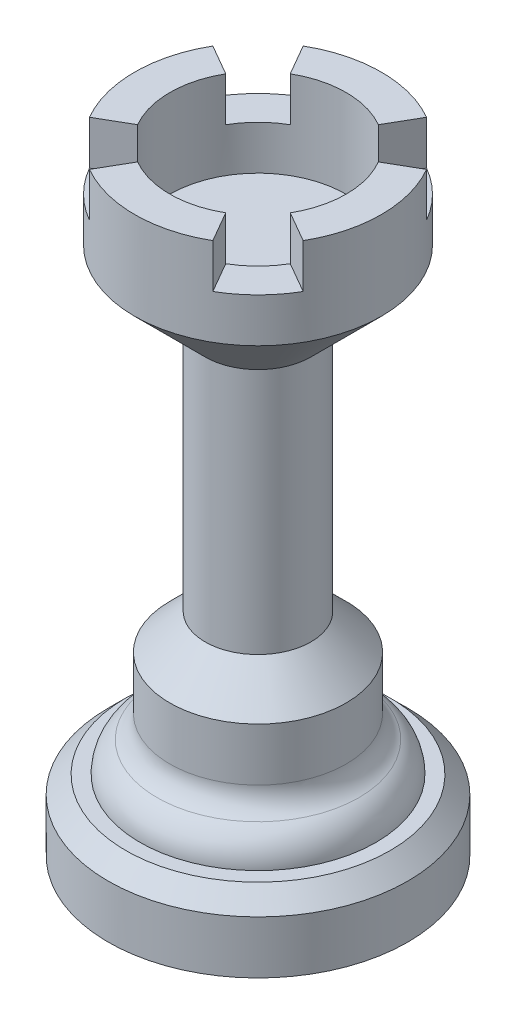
from build123d import *

# Parameters (mm, degrees)
CORTAR_EXTRUIR1_DEPTH = 5
MATRIZC1_COUNT        = 4
CHAFL_N1_SIZE         = 2


with BuildPart() as part:
    # Croquis1 → Revoluci_n1 (revolve)
    with BuildSketch(Plane.XY):
        with BuildLine():
            Line((0, 0), (17, 0))
            Line((17, 0), (17, 8))
            Line((17, 8), (13.394448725, 8))
            ThreePointArc((13.394448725, 8), (12.875918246, 9.969611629), (11.454763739, 11.428571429))
            ThreePointArc((11.454763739, 11.428571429), (10.388897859, 12.522791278), (10, 14))
            Line((10, 14), (10, 20))
            Line((10, 20), (6, 24))
            Line((6, 24), (6, 52))
            Line((6, 52), (14, 60))
            Line((14, 60), (14, 70))
            Line((14, 70), (10, 70))
            Line((10, 70), (10, 60))
            Line((10, 60), (0, 60))
            Line((0, 60), (0, 0))
        make_face()
    revolve(axis=Axis((0, -173.601878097, 0), (0, 1, 0)))

    # Croquis2 → Cortar-Extruir1 (cut)
    with BuildSketch(Plane(origin=(0, 70, 0), x_dir=(1, 0, 0), z_dir=(0, 1, 0))):
        with BuildLine():
            ThreePointArc((5, 8.660254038), (7.071067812, 7.071067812), (8.660254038, 5))
            Line((8.660254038, 5), (12.124355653, 7))
            ThreePointArc((12.124355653, 7), (9.899494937, 9.899494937), (7, 12.124355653))
            Line((7, 12.124355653), (5, 8.660254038))
        make_face()
    cortar_extruir1 = extrude(amount=-CORTAR_EXTRUIR1_DEPTH, mode=Mode.SUBTRACT)

    # MatrizC1: Cortar-Extruir1 ×4 about axis
    matrizc1_axis = Axis((0, 79.44372397, 0), (0, -1, 0))
    for i in range(1, MATRIZC1_COUNT):
        add(cortar_extruir1.rotate(matrizc1_axis, i * 360 / MATRIZC1_COUNT), mode=Mode.SUBTRACT)

    # Chafl_n1
    chafl_n1_edges = [part.edges().sort_by_distance(p)[0] for p in [
        (-17, 8, 0),
    ]]
    chamfer(chafl_n1_edges, length=CHAFL_N1_SIZE)


solid = part.part
